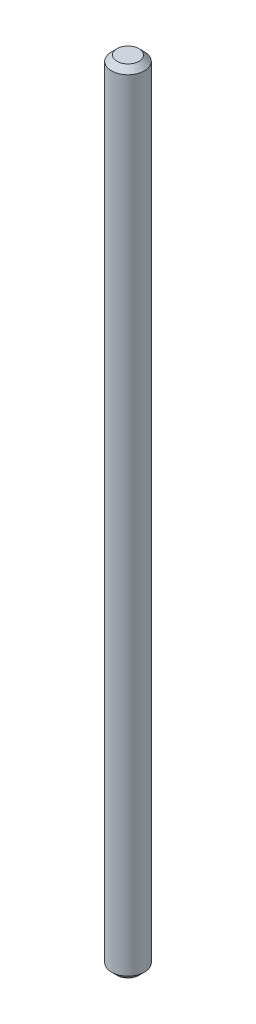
from build123d import *

# Parameters (mm, degrees)
SKETCH1_R      = 1.5
EXTRUDE1_DEPTH = 72
CHAMFER1_SIZE  = 0.5


with BuildPart() as part:
    # Sketch1 → Extrude1 (new body)
    with BuildSketch(Plane(origin=(0, 0, 0), x_dir=(1, 0, 0), z_dir=(0, 1, 0))):
        with Locations(Location((0, 0, 0), (0, 0, 270))):
            Circle(SKETCH1_R)
    extrude(amount=EXTRUDE1_DEPTH)

    # Chamfer1
    chamfer1_edges = [part.edges().sort_by_distance(p)[0] for p in [
        (0, 0, -1.5),
        (0, 72, -1.5),
    ]]
    chamfer(chamfer1_edges, length=CHAMFER1_SIZE)


solid = part.part
